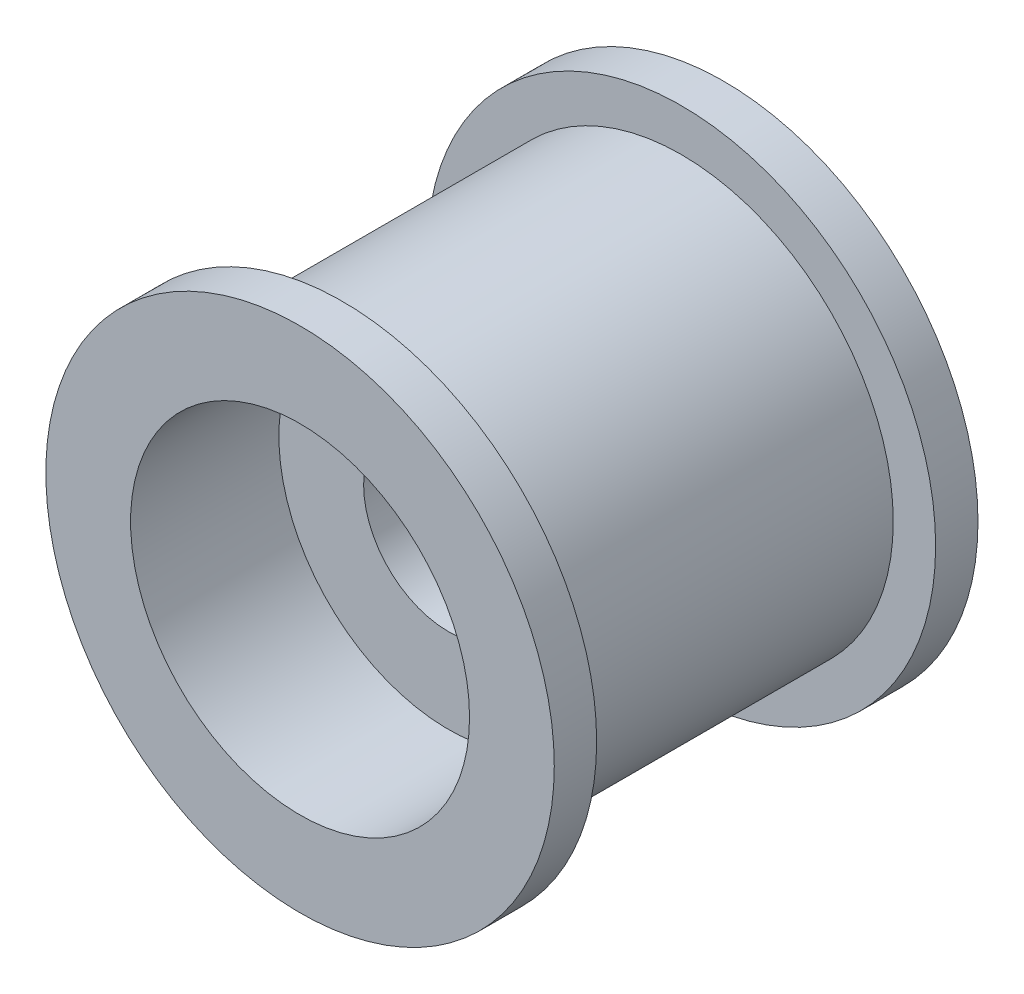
from build123d import *

# Parameters (mm, degrees)
SKETCH_1_R          = 6
EXTRUDE_1_DEPTH     = 10
CUT_EXTRUDE_START   = -9
SKETCH_2_R          = 6
SKETCH_2_R_2        = 5
CUT_EXTRUDE_1_DEPTH = 8
SKETCH_3_R          = 4
CUT_EXTRUDE_2_DEPTH = 3.5
SKETCH_4_R          = 2
CUT_EXTRUDE_3_DEPTH = 11.688779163


with BuildPart() as part:
    # Sketch 1 → Extrude 1 (new body)
    with BuildSketch(Plane.XY):
        Circle(SKETCH_1_R)
    extrude(amount=EXTRUDE_1_DEPTH)

    # Sketch 2 → Cut-Extrude 1 (cut)
    with BuildSketch(Plane.XY.offset(10).offset(CUT_EXTRUDE_START)):
        Circle(SKETCH_2_R)
        Circle(SKETCH_2_R_2, mode=Mode.SUBTRACT)
    extrude(amount=CUT_EXTRUDE_1_DEPTH, mode=Mode.SUBTRACT)

    # Sketch 3 → Cut-Extrude 2 (cut)
    with BuildSketch(Plane.XY.offset(10)):
        Circle(SKETCH_3_R)
    cut_extrude_2 = extrude(amount=-CUT_EXTRUDE_2_DEPTH, mode=Mode.SUBTRACT)

    # Mirror 1: Cut-Extrude 2 across plane
    add(cut_extrude_2.mirror(Plane.XY.offset(5)), mode=Mode.SUBTRACT)

    # Sketch 4 → Cut-Extrude 3 (cut, through all)
    with BuildSketch(Plane(origin=(0, 0, 3.5), x_dir=(-1, 0, 0), z_dir=(0, 0, -1))):
        Circle(SKETCH_4_R)
    extrude(amount=-CUT_EXTRUDE_3_DEPTH, mode=Mode.SUBTRACT)


solid = part.part
